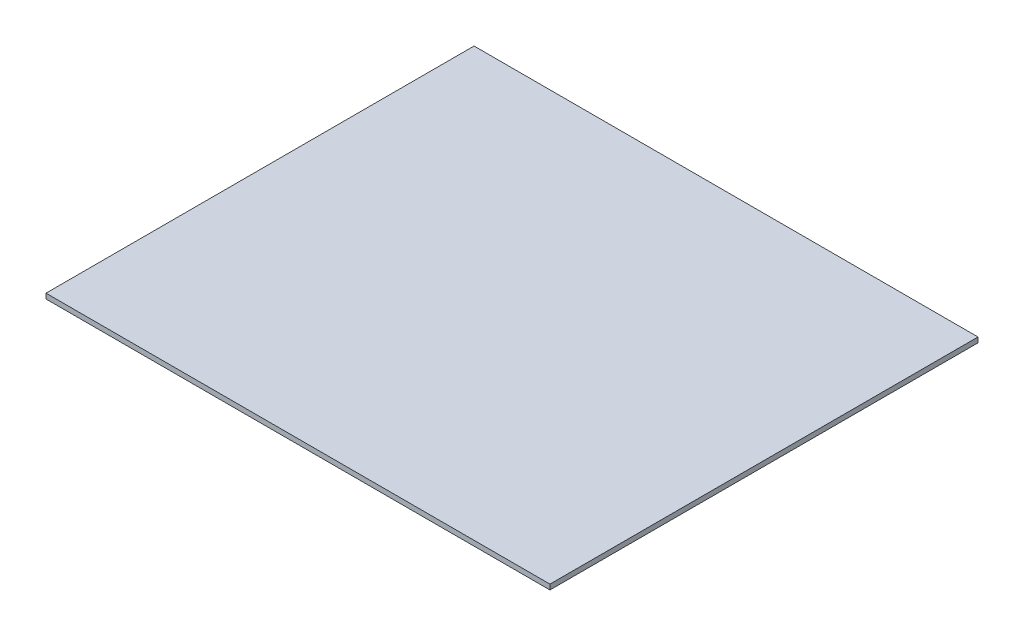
ISO-10303-21;
HEADER;
FILE_DESCRIPTION(('STEP AP214'),'2;1');
FILE_NAME('part.step','',(''),(''),'','','');
FILE_SCHEMA(('AUTOMOTIVE_DESIGN { 1 0 10303 214 1 1 1 1 }'));
ENDSEC;
DATA;
#1=APPLICATION_CONTEXT('core data for automotive mechanical design processes');
#2=APPLICATION_PROTOCOL_DEFINITION('international standard','automotive_design',2000,#1);
#3=PRODUCT_CONTEXT('',#1,'mechanical');
#4=PRODUCT('Part','Part','',(#3));
#5=PRODUCT_RELATED_PRODUCT_CATEGORY('part','',(#4));
#6=PRODUCT_DEFINITION_FORMATION('','',#4);
#7=PRODUCT_DEFINITION_CONTEXT('part definition',#1,'design');
#8=PRODUCT_DEFINITION('design','',#6,#7);
#9=PRODUCT_DEFINITION_SHAPE('','',#8);
#10=(LENGTH_UNIT() NAMED_UNIT(*) SI_UNIT(.MILLI.,.METRE.));
#11=(NAMED_UNIT(*) PLANE_ANGLE_UNIT() SI_UNIT($,.RADIAN.));
#12=(NAMED_UNIT(*) SI_UNIT($,.STERADIAN.) SOLID_ANGLE_UNIT());
#13=UNCERTAINTY_MEASURE_WITH_UNIT(LENGTH_MEASURE(1.E-05),#10,'distance_accuracy_value','');
#14=(GEOMETRIC_REPRESENTATION_CONTEXT(3) GLOBAL_UNCERTAINTY_ASSIGNED_CONTEXT((#13)) GLOBAL_UNIT_ASSIGNED_CONTEXT((#10,
#11,#12)) REPRESENTATION_CONTEXT('',''));
#15=CARTESIAN_POINT('',(0.,0.,0.));
#16=DIRECTION('',(0.,0.,1.));
#17=DIRECTION('',(1.,0.,0.));
#18=AXIS2_PLACEMENT_3D('',#15,#16,#17);
#19=CARTESIAN_POINT('',(-104.912319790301,0.,100.));
#20=DIRECTION('',(1.,0.,0.));
#21=DIRECTION('',(0.,0.,-1.));
#22=AXIS2_PLACEMENT_3D('',#19,#20,#21);
#23=PLANE('',#22);
#24=DIRECTION('',(0.,0.,-1.));
#25=VECTOR('',#24,1.);
#26=CARTESIAN_POINT('',(-104.912319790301,0.,100.));
#27=LINE('',#26,#25);
#28=CARTESIAN_POINT('',(-104.912319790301,0.,100.));
#29=VERTEX_POINT('',#28);
#30=CARTESIAN_POINT('',(-104.912319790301,0.,-100.));
#31=VERTEX_POINT('',#30);
#32=EDGE_CURVE('E83',#29,#31,#27,.T.);
#33=ORIENTED_EDGE('',*,*,#32,.T.);
#34=DIRECTION('',(0.,-1.,0.));
#35=VECTOR('',#34,1.);
#36=CARTESIAN_POINT('',(-104.912319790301,0.,-100.));
#37=LINE('',#36,#35);
#38=CARTESIAN_POINT('',(-104.912319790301,-2.38020969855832,-100.));
#39=VERTEX_POINT('',#38);
#40=EDGE_CURVE('E78',#31,#39,#37,.T.);
#41=ORIENTED_EDGE('',*,*,#40,.T.);
#42=DIRECTION('',(0.,0.,-1.));
#43=VECTOR('',#42,1.);
#44=CARTESIAN_POINT('',(-104.912319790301,-2.38020969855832,100.));
#45=LINE('',#44,#43);
#46=CARTESIAN_POINT('',(-104.912319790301,-2.38020969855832,100.));
#47=VERTEX_POINT('',#46);
#48=EDGE_CURVE('E11',#47,#39,#45,.T.);
#49=ORIENTED_EDGE('',*,*,#48,.F.);
#50=DIRECTION('',(0.,-1.,0.));
#51=VECTOR('',#50,1.);
#52=CARTESIAN_POINT('',(-104.912319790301,0.,100.));
#53=LINE('',#52,#51);
#54=EDGE_CURVE('E89',#29,#47,#53,.T.);
#55=ORIENTED_EDGE('',*,*,#54,.F.);
#56=EDGE_LOOP('',(#33,#41,#49,#55));
#57=FACE_BOUND('',#56,.T.);
#58=ADVANCED_FACE('F26',(#57),#23,.F.);
#59=CARTESIAN_POINT('',(-104.912319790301,-2.38020969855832,100.));
#60=DIRECTION('',(0.,1.,0.));
#61=DIRECTION('',(0.,0.,1.));
#62=AXIS2_PLACEMENT_3D('',#59,#60,#61);
#63=PLANE('',#62);
#64=ORIENTED_EDGE('',*,*,#48,.T.);
#65=DIRECTION('',(1.,0.,0.));
#66=VECTOR('',#65,1.);
#67=CARTESIAN_POINT('',(-104.912319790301,-2.38020969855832,-100.));
#68=LINE('',#67,#66);
#69=CARTESIAN_POINT('',(130.545347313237,-2.38020969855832,-100.));
#70=VERTEX_POINT('',#69);
#71=EDGE_CURVE('E68',#39,#70,#68,.T.);
#72=ORIENTED_EDGE('',*,*,#71,.T.);
#73=DIRECTION('',(0.,0.,-1.));
#74=VECTOR('',#73,1.);
#75=CARTESIAN_POINT('',(130.545347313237,-2.38020969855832,100.));
#76=LINE('',#75,#74);
#77=CARTESIAN_POINT('',(130.545347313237,-2.38020969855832,100.));
#78=VERTEX_POINT('',#77);
#79=EDGE_CURVE('E33',#78,#70,#76,.T.);
#80=ORIENTED_EDGE('',*,*,#79,.F.);
#81=DIRECTION('',(1.,0.,0.));
#82=VECTOR('',#81,1.);
#83=CARTESIAN_POINT('',(-104.912319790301,-2.38020969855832,100.));
#84=LINE('',#83,#82);
#85=EDGE_CURVE('E69',#47,#78,#84,.T.);
#86=ORIENTED_EDGE('',*,*,#85,.F.);
#87=EDGE_LOOP('',(#64,#72,#80,#86));
#88=FACE_BOUND('',#87,.T.);
#89=ADVANCED_FACE('F66',(#88),#63,.F.);
#90=CARTESIAN_POINT('',(130.545347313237,0.,100.));
#91=DIRECTION('',(-1.,0.,0.));
#92=DIRECTION('',(0.,0.,1.));
#93=AXIS2_PLACEMENT_3D('',#90,#91,#92);
#94=PLANE('',#93);
#95=ORIENTED_EDGE('',*,*,#79,.T.);
#96=DIRECTION('',(0.,1.,0.));
#97=VECTOR('',#96,1.);
#98=CARTESIAN_POINT('',(130.545347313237,0.,-100.));
#99=LINE('',#98,#97);
#100=CARTESIAN_POINT('',(130.545347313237,0.,-100.));
#101=VERTEX_POINT('',#100);
#102=EDGE_CURVE('E81',#70,#101,#99,.T.);
#103=ORIENTED_EDGE('',*,*,#102,.T.);
#104=DIRECTION('',(0.,0.,-1.));
#105=VECTOR('',#104,1.);
#106=CARTESIAN_POINT('',(130.545347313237,0.,100.));
#107=LINE('',#106,#105);
#108=CARTESIAN_POINT('',(130.545347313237,0.,100.));
#109=VERTEX_POINT('',#108);
#110=EDGE_CURVE('E95',#109,#101,#107,.T.);
#111=ORIENTED_EDGE('',*,*,#110,.F.);
#112=DIRECTION('',(0.,1.,0.));
#113=VECTOR('',#112,1.);
#114=CARTESIAN_POINT('',(130.545347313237,0.,100.));
#115=LINE('',#114,#113);
#116=EDGE_CURVE('E45',#78,#109,#115,.T.);
#117=ORIENTED_EDGE('',*,*,#116,.F.);
#118=EDGE_LOOP('',(#95,#103,#111,#117));
#119=FACE_BOUND('',#118,.T.);
#120=ADVANCED_FACE('F97',(#119),#94,.F.);
#121=CARTESIAN_POINT('',(-104.912319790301,0.,100.));
#122=DIRECTION('',(0.,-1.,0.));
#123=DIRECTION('',(0.,0.,-1.));
#124=AXIS2_PLACEMENT_3D('',#121,#122,#123);
#125=PLANE('',#124);
#126=ORIENTED_EDGE('',*,*,#110,.T.);
#127=DIRECTION('',(-1.,0.,0.));
#128=VECTOR('',#127,1.);
#129=CARTESIAN_POINT('',(-104.912319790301,0.,-100.));
#130=LINE('',#129,#128);
#131=EDGE_CURVE('E87',#101,#31,#130,.T.);
#132=ORIENTED_EDGE('',*,*,#131,.T.);
#133=ORIENTED_EDGE('',*,*,#32,.F.);
#134=DIRECTION('',(-1.,0.,0.));
#135=VECTOR('',#134,1.);
#136=CARTESIAN_POINT('',(-104.912319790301,0.,100.));
#137=LINE('',#136,#135);
#138=EDGE_CURVE('E40',#109,#29,#137,.T.);
#139=ORIENTED_EDGE('',*,*,#138,.F.);
#140=EDGE_LOOP('',(#126,#132,#133,#139));
#141=FACE_BOUND('',#140,.T.);
#142=ADVANCED_FACE('F99',(#141),#125,.F.);
#143=CARTESIAN_POINT('',(-104.912319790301,-2.38020969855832,100.));
#144=DIRECTION('',(0.,0.,1.));
#145=DIRECTION('',(1.,0.,0.));
#146=AXIS2_PLACEMENT_3D('',#143,#144,#145);
#147=PLANE('',#146);
#148=ORIENTED_EDGE('',*,*,#54,.T.);
#149=ORIENTED_EDGE('',*,*,#85,.T.);
#150=ORIENTED_EDGE('',*,*,#116,.T.);
#151=ORIENTED_EDGE('',*,*,#138,.T.);
#152=EDGE_LOOP('',(#148,#149,#150,#151));
#153=FACE_BOUND('',#152,.T.);
#154=ADVANCED_FACE('F100',(#153),#147,.T.);
#155=CARTESIAN_POINT('',(-104.912319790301,-2.38020969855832,-100.));
#156=DIRECTION('',(0.,0.,1.));
#157=DIRECTION('',(1.,0.,0.));
#158=AXIS2_PLACEMENT_3D('',#155,#156,#157);
#159=PLANE('',#158);
#160=ORIENTED_EDGE('',*,*,#40,.F.);
#161=ORIENTED_EDGE('',*,*,#131,.F.);
#162=ORIENTED_EDGE('',*,*,#102,.F.);
#163=ORIENTED_EDGE('',*,*,#71,.F.);
#164=EDGE_LOOP('',(#160,#161,#162,#163));
#165=FACE_BOUND('',#164,.T.);
#166=ADVANCED_FACE('F76',(#165),#159,.F.);
#167=CLOSED_SHELL('',(#58,#89,#120,#142,#154,#166));
#168=MANIFOLD_SOLID_BREP('B2',#167);
#169=ADVANCED_BREP_SHAPE_REPRESENTATION('',(#18,#168),#14);
#170=SHAPE_DEFINITION_REPRESENTATION(#9,#169);
ENDSEC;
END-ISO-10303-21;
